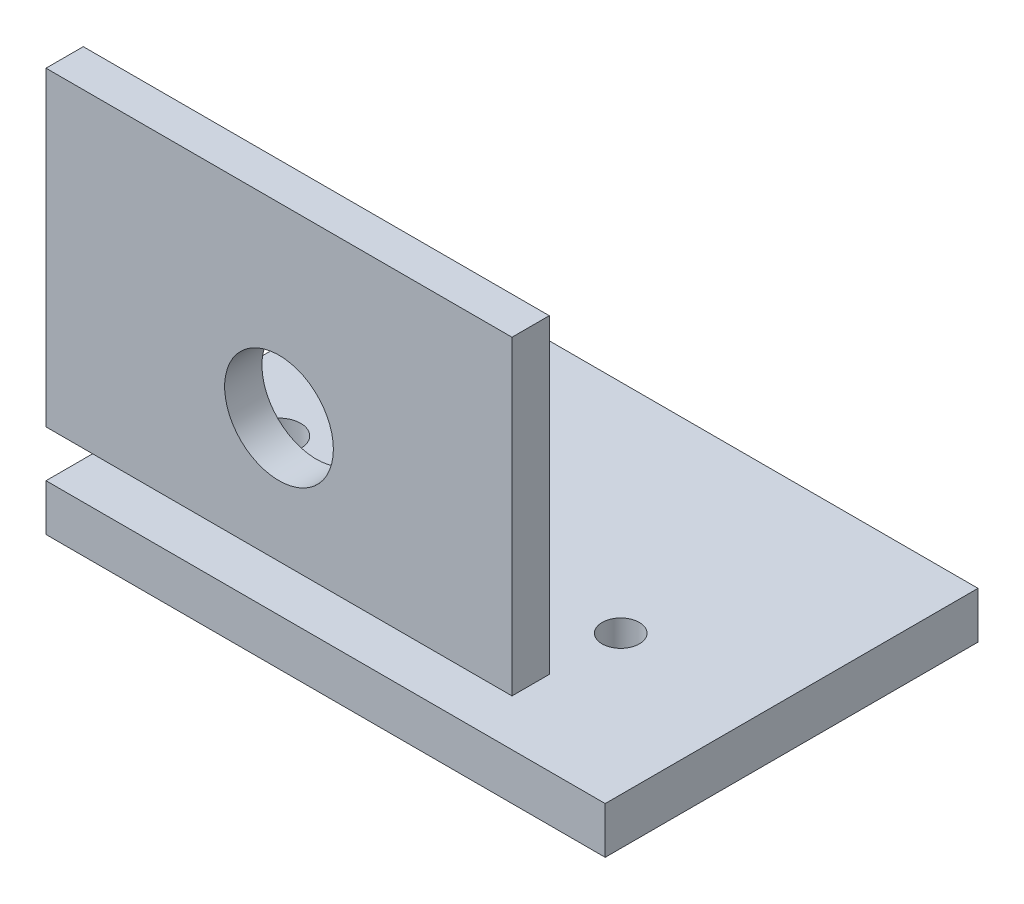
from build123d import *

# Parameters (mm, degrees)
SKETCH_1_W          = 180
SKETCH_1_H          = 120
EXTRUDE_1_DEPTH     = 15
SKETCH_2_R          = 7
SKETCH_2_R_2        = 6
CUT_EXTRUDE_1_DEPTH = 15
SKETCH_3_W          = 150
SKETCH_3_H          = 100
EXTRUDE_2_DEPTH     = 12
SKETCH_4_R          = 17.5
CUT_EXTRUDE_2_DEPTH = 12


with BuildPart() as part:
    # Sketch 1 → Extrude 1 (new body)
    with BuildSketch(Plane(origin=(0, 0, 0), x_dir=(1, 0, 0), z_dir=(0, 1, 0))):
        with Locations((90, 60)):
            Rectangle(SKETCH_1_W, SKETCH_1_H)
    extrude(amount=-EXTRUDE_1_DEPTH)

    # Sketch 2 → Cut-Extrude 1 (cut)
    with BuildSketch(Plane(origin=(0, 0, 0), x_dir=(1, 0, 0), z_dir=(0, 1, 0))):
        with Locations(Location((25, 50, 0), (0, 0, 270))):
            Circle(SKETCH_2_R)
        with Locations(Location((135, 50, 0), (0, 0, 270))):
            Circle(SKETCH_2_R_2)
    extrude(amount=-CUT_EXTRUDE_1_DEPTH, mode=Mode.SUBTRACT)


with BuildPart() as body_2:
    # Sketch 3 → Extrude 2 (new body)
    with BuildSketch(Plane.XY):
        with Locations((75, 65)):
            Rectangle(SKETCH_3_W, SKETCH_3_H)
    extrude(amount=-EXTRUDE_2_DEPTH)

    # Sketch 4 → Cut-Extrude 2 (cut)
    with BuildSketch(Plane.XY):
        with Locations((75, 55)):
            Circle(SKETCH_4_R)
    extrude(amount=-CUT_EXTRUDE_2_DEPTH, mode=Mode.SUBTRACT)


solid = Compound([part.part, body_2.part])
